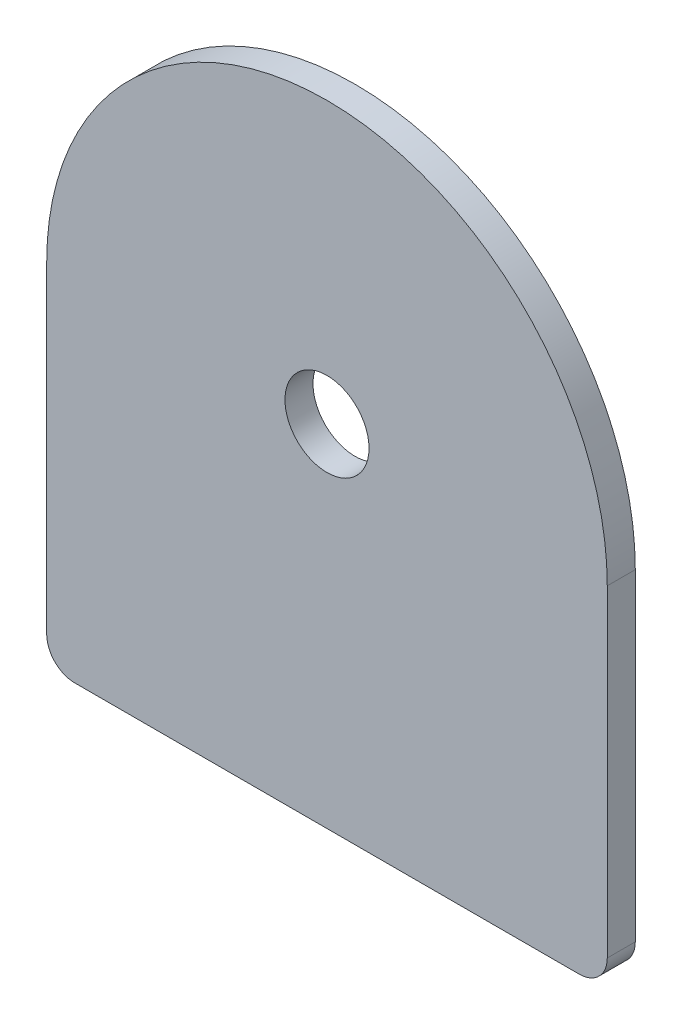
ISO-10303-21;
HEADER;
FILE_DESCRIPTION(('STEP AP214'),'2;1');
FILE_NAME('part.step','',(''),(''),'','','');
FILE_SCHEMA(('AUTOMOTIVE_DESIGN { 1 0 10303 214 1 1 1 1 }'));
ENDSEC;
DATA;
#1=APPLICATION_CONTEXT('core data for automotive mechanical design processes');
#2=APPLICATION_PROTOCOL_DEFINITION('international standard','automotive_design',2000,#1);
#3=PRODUCT_CONTEXT('',#1,'mechanical');
#4=PRODUCT('Part','Part','',(#3));
#5=PRODUCT_RELATED_PRODUCT_CATEGORY('part','',(#4));
#6=PRODUCT_DEFINITION_FORMATION('','',#4);
#7=PRODUCT_DEFINITION_CONTEXT('part definition',#1,'design');
#8=PRODUCT_DEFINITION('design','',#6,#7);
#9=PRODUCT_DEFINITION_SHAPE('','',#8);
#10=(LENGTH_UNIT() NAMED_UNIT(*) SI_UNIT(.MILLI.,.METRE.));
#11=(NAMED_UNIT(*) PLANE_ANGLE_UNIT() SI_UNIT($,.RADIAN.));
#12=(NAMED_UNIT(*) SI_UNIT($,.STERADIAN.) SOLID_ANGLE_UNIT());
#13=UNCERTAINTY_MEASURE_WITH_UNIT(LENGTH_MEASURE(1.E-05),#10,'distance_accuracy_value','');
#14=(GEOMETRIC_REPRESENTATION_CONTEXT(3) GLOBAL_UNCERTAINTY_ASSIGNED_CONTEXT((#13)) GLOBAL_UNIT_ASSIGNED_CONTEXT((#10,
#11,#12)) REPRESENTATION_CONTEXT('',''));
#15=CARTESIAN_POINT('',(0.,0.,0.));
#16=DIRECTION('',(0.,0.,1.));
#17=DIRECTION('',(1.,0.,0.));
#18=AXIS2_PLACEMENT_3D('',#15,#16,#17);
#19=CARTESIAN_POINT('',(0.,0.,2.));
#20=DIRECTION('',(0.,0.,1.));
#21=DIRECTION('',(1.,0.,0.));
#22=AXIS2_PLACEMENT_3D('',#19,#20,#21);
#23=PLANE('',#22);
#24=CARTESIAN_POINT('',(0.,0.,2.));
#25=DIRECTION('',(0.,0.,1.));
#26=DIRECTION('',(1.,0.,0.));
#27=AXIS2_PLACEMENT_3D('',#24,#25,#26);
#28=CIRCLE('',#27,20.);
#29=CARTESIAN_POINT('',(20.,0.,2.));
#30=VERTEX_POINT('',#29);
#31=CARTESIAN_POINT('',(-20.,0.,2.));
#32=VERTEX_POINT('',#31);
#33=EDGE_CURVE('E112',#30,#32,#28,.T.);
#34=ORIENTED_EDGE('',*,*,#33,.T.);
#35=DIRECTION('',(0.,-1.,0.));
#36=VECTOR('',#35,1.);
#37=CARTESIAN_POINT('',(-20.,0.,2.));
#38=LINE('',#37,#36);
#39=CARTESIAN_POINT('',(-20.,-23.,2.));
#40=VERTEX_POINT('',#39);
#41=EDGE_CURVE('E93',#32,#40,#38,.T.);
#42=ORIENTED_EDGE('',*,*,#41,.T.);
#43=CARTESIAN_POINT('',(-18.,-23.,2.));
#44=DIRECTION('',(0.,0.,1.));
#45=DIRECTION('',(1.,0.,0.));
#46=AXIS2_PLACEMENT_3D('',#43,#44,#45);
#47=CIRCLE('',#46,2.);
#48=CARTESIAN_POINT('',(-18.,-25.,2.));
#49=VERTEX_POINT('',#48);
#50=EDGE_CURVE('E115',#40,#49,#47,.T.);
#51=ORIENTED_EDGE('',*,*,#50,.T.);
#52=DIRECTION('',(1.,0.,0.));
#53=VECTOR('',#52,1.);
#54=CARTESIAN_POINT('',(-18.,-25.,2.));
#55=LINE('',#54,#53);
#56=CARTESIAN_POINT('',(18.,-25.,2.));
#57=VERTEX_POINT('',#56);
#58=EDGE_CURVE('E117',#49,#57,#55,.T.);
#59=ORIENTED_EDGE('',*,*,#58,.T.);
#60=CARTESIAN_POINT('',(18.,-23.,2.));
#61=DIRECTION('',(0.,0.,1.));
#62=DIRECTION('',(1.,0.,0.));
#63=AXIS2_PLACEMENT_3D('',#60,#61,#62);
#64=CIRCLE('',#63,2.);
#65=CARTESIAN_POINT('',(20.,-23.,2.));
#66=VERTEX_POINT('',#65);
#67=EDGE_CURVE('E46',#57,#66,#64,.T.);
#68=ORIENTED_EDGE('',*,*,#67,.T.);
#69=DIRECTION('',(0.,1.,0.));
#70=VECTOR('',#69,1.);
#71=CARTESIAN_POINT('',(20.,0.,2.));
#72=LINE('',#71,#70);
#73=EDGE_CURVE('E41',#66,#30,#72,.T.);
#74=ORIENTED_EDGE('',*,*,#73,.T.);
#75=EDGE_LOOP('',(#34,#42,#51,#59,#68,#74));
#76=FACE_BOUND('',#75,.T.);
#77=CARTESIAN_POINT('',(0.,0.,2.));
#78=DIRECTION('',(0.,0.,1.));
#79=DIRECTION('',(1.,0.,0.));
#80=AXIS2_PLACEMENT_3D('',#77,#78,#79);
#81=CIRCLE('',#80,3.);
#82=CARTESIAN_POINT('',(3.,0.,2.));
#83=VERTEX_POINT('',#82);
#84=EDGE_CURVE('E98',#83,#83,#81,.T.);
#85=ORIENTED_EDGE('',*,*,#84,.F.);
#86=EDGE_LOOP('',(#85));
#87=FACE_BOUND('',#86,.T.);
#88=ADVANCED_FACE('F26',(#76,#87),#23,.T.);
#89=CARTESIAN_POINT('',(0.,0.,0.));
#90=DIRECTION('',(0.,0.,1.));
#91=DIRECTION('',(1.,0.,0.));
#92=AXIS2_PLACEMENT_3D('',#89,#90,#91);
#93=PLANE('',#92);
#94=CARTESIAN_POINT('',(0.,0.,0.));
#95=DIRECTION('',(0.,0.,1.));
#96=DIRECTION('',(1.,0.,0.));
#97=AXIS2_PLACEMENT_3D('',#94,#95,#96);
#98=CIRCLE('',#97,20.);
#99=CARTESIAN_POINT('',(20.,0.,0.));
#100=VERTEX_POINT('',#99);
#101=CARTESIAN_POINT('',(-20.,0.,0.));
#102=VERTEX_POINT('',#101);
#103=EDGE_CURVE('E84',#100,#102,#98,.T.);
#104=ORIENTED_EDGE('',*,*,#103,.F.);
#105=DIRECTION('',(0.,1.,0.));
#106=VECTOR('',#105,1.);
#107=CARTESIAN_POINT('',(20.,0.,0.));
#108=LINE('',#107,#106);
#109=CARTESIAN_POINT('',(20.,-23.,0.));
#110=VERTEX_POINT('',#109);
#111=EDGE_CURVE('E110',#110,#100,#108,.T.);
#112=ORIENTED_EDGE('',*,*,#111,.F.);
#113=CARTESIAN_POINT('',(18.,-23.,0.));
#114=DIRECTION('',(0.,0.,1.));
#115=DIRECTION('',(1.,0.,0.));
#116=AXIS2_PLACEMENT_3D('',#113,#114,#115);
#117=CIRCLE('',#116,2.);
#118=CARTESIAN_POINT('',(18.,-25.,0.));
#119=VERTEX_POINT('',#118);
#120=EDGE_CURVE('E108',#119,#110,#117,.T.);
#121=ORIENTED_EDGE('',*,*,#120,.F.);
#122=DIRECTION('',(1.,0.,0.));
#123=VECTOR('',#122,1.);
#124=CARTESIAN_POINT('',(-18.,-25.,0.));
#125=LINE('',#124,#123);
#126=CARTESIAN_POINT('',(-18.,-25.,0.));
#127=VERTEX_POINT('',#126);
#128=EDGE_CURVE('E106',#127,#119,#125,.T.);
#129=ORIENTED_EDGE('',*,*,#128,.F.);
#130=CARTESIAN_POINT('',(-18.,-23.,0.));
#131=DIRECTION('',(0.,0.,1.));
#132=DIRECTION('',(1.,0.,0.));
#133=AXIS2_PLACEMENT_3D('',#130,#131,#132);
#134=CIRCLE('',#133,2.);
#135=CARTESIAN_POINT('',(-20.,-23.,0.));
#136=VERTEX_POINT('',#135);
#137=EDGE_CURVE('E86',#136,#127,#134,.T.);
#138=ORIENTED_EDGE('',*,*,#137,.F.);
#139=DIRECTION('',(0.,-1.,0.));
#140=VECTOR('',#139,1.);
#141=CARTESIAN_POINT('',(-20.,0.,0.));
#142=LINE('',#141,#140);
#143=EDGE_CURVE('E79',#102,#136,#142,.T.);
#144=ORIENTED_EDGE('',*,*,#143,.F.);
#145=EDGE_LOOP('',(#104,#112,#121,#129,#138,#144));
#146=FACE_BOUND('',#145,.T.);
#147=CARTESIAN_POINT('',(0.,0.,0.));
#148=DIRECTION('',(0.,0.,1.));
#149=DIRECTION('',(1.,0.,0.));
#150=AXIS2_PLACEMENT_3D('',#147,#148,#149);
#151=CIRCLE('',#150,3.);
#152=CARTESIAN_POINT('',(3.,0.,0.));
#153=VERTEX_POINT('',#152);
#154=EDGE_CURVE('E101',#153,#153,#151,.T.);
#155=ORIENTED_EDGE('',*,*,#154,.T.);
#156=EDGE_LOOP('',(#155));
#157=FACE_BOUND('',#156,.T.);
#158=ADVANCED_FACE('F80',(#146,#157),#93,.F.);
#159=CARTESIAN_POINT('',(0.,0.,2.));
#160=DIRECTION('',(0.,0.,-1.));
#161=DIRECTION('',(-1.,0.,0.));
#162=AXIS2_PLACEMENT_3D('',#159,#160,#161);
#163=CYLINDRICAL_SURFACE('',#162,20.);
#164=ORIENTED_EDGE('',*,*,#103,.T.);
#165=DIRECTION('',(0.,0.,-1.));
#166=VECTOR('',#165,1.);
#167=CARTESIAN_POINT('',(-20.,0.,2.));
#168=LINE('',#167,#166);
#169=EDGE_CURVE('E11',#32,#102,#168,.T.);
#170=ORIENTED_EDGE('',*,*,#169,.F.);
#171=ORIENTED_EDGE('',*,*,#33,.F.);
#172=DIRECTION('',(0.,0.,-1.));
#173=VECTOR('',#172,1.);
#174=CARTESIAN_POINT('',(20.,0.,2.));
#175=LINE('',#174,#173);
#176=EDGE_CURVE('E97',#30,#100,#175,.T.);
#177=ORIENTED_EDGE('',*,*,#176,.T.);
#178=EDGE_LOOP('',(#164,#170,#171,#177));
#179=FACE_BOUND('',#178,.T.);
#180=ADVANCED_FACE('F28',(#179),#163,.T.);
#181=CARTESIAN_POINT('',(-20.,0.,2.));
#182=DIRECTION('',(1.,0.,0.));
#183=DIRECTION('',(0.,0.,-1.));
#184=AXIS2_PLACEMENT_3D('',#181,#182,#183);
#185=PLANE('',#184);
#186=ORIENTED_EDGE('',*,*,#143,.T.);
#187=DIRECTION('',(0.,0.,-1.));
#188=VECTOR('',#187,1.);
#189=CARTESIAN_POINT('',(-20.,-23.,2.));
#190=LINE('',#189,#188);
#191=EDGE_CURVE('E34',#40,#136,#190,.T.);
#192=ORIENTED_EDGE('',*,*,#191,.F.);
#193=ORIENTED_EDGE('',*,*,#41,.F.);
#194=ORIENTED_EDGE('',*,*,#169,.T.);
#195=EDGE_LOOP('',(#186,#192,#193,#194));
#196=FACE_BOUND('',#195,.T.);
#197=ADVANCED_FACE('F92',(#196),#185,.F.);
#198=CARTESIAN_POINT('',(-18.,-23.,2.));
#199=DIRECTION('',(0.,0.,-1.));
#200=DIRECTION('',(-1.,0.,0.));
#201=AXIS2_PLACEMENT_3D('',#198,#199,#200);
#202=CYLINDRICAL_SURFACE('',#201,2.);
#203=ORIENTED_EDGE('',*,*,#137,.T.);
#204=DIRECTION('',(0.,0.,-1.));
#205=VECTOR('',#204,1.);
#206=CARTESIAN_POINT('',(-18.,-25.,2.));
#207=LINE('',#206,#205);
#208=EDGE_CURVE('E128',#49,#127,#207,.T.);
#209=ORIENTED_EDGE('',*,*,#208,.F.);
#210=ORIENTED_EDGE('',*,*,#50,.F.);
#211=ORIENTED_EDGE('',*,*,#191,.T.);
#212=EDGE_LOOP('',(#203,#209,#210,#211));
#213=FACE_BOUND('',#212,.T.);
#214=ADVANCED_FACE('F132',(#213),#202,.T.);
#215=CARTESIAN_POINT('',(-18.,-25.,2.));
#216=DIRECTION('',(0.,1.,0.));
#217=DIRECTION('',(0.,0.,1.));
#218=AXIS2_PLACEMENT_3D('',#215,#216,#217);
#219=PLANE('',#218);
#220=ORIENTED_EDGE('',*,*,#128,.T.);
#221=DIRECTION('',(0.,0.,-1.));
#222=VECTOR('',#221,1.);
#223=CARTESIAN_POINT('',(18.,-25.,2.));
#224=LINE('',#223,#222);
#225=EDGE_CURVE('E125',#57,#119,#224,.T.);
#226=ORIENTED_EDGE('',*,*,#225,.F.);
#227=ORIENTED_EDGE('',*,*,#58,.F.);
#228=ORIENTED_EDGE('',*,*,#208,.T.);
#229=EDGE_LOOP('',(#220,#226,#227,#228));
#230=FACE_BOUND('',#229,.T.);
#231=ADVANCED_FACE('F138',(#230),#219,.F.);
#232=CARTESIAN_POINT('',(18.,-23.,2.));
#233=DIRECTION('',(0.,0.,-1.));
#234=DIRECTION('',(-1.,0.,0.));
#235=AXIS2_PLACEMENT_3D('',#232,#233,#234);
#236=CYLINDRICAL_SURFACE('',#235,2.);
#237=ORIENTED_EDGE('',*,*,#120,.T.);
#238=DIRECTION('',(0.,0.,-1.));
#239=VECTOR('',#238,1.);
#240=CARTESIAN_POINT('',(20.,-23.,2.));
#241=LINE('',#240,#239);
#242=EDGE_CURVE('E122',#66,#110,#241,.T.);
#243=ORIENTED_EDGE('',*,*,#242,.F.);
#244=ORIENTED_EDGE('',*,*,#67,.F.);
#245=ORIENTED_EDGE('',*,*,#225,.T.);
#246=EDGE_LOOP('',(#237,#243,#244,#245));
#247=FACE_BOUND('',#246,.T.);
#248=ADVANCED_FACE('F141',(#247),#236,.T.);
#249=CARTESIAN_POINT('',(20.,0.,2.));
#250=DIRECTION('',(-1.,0.,0.));
#251=DIRECTION('',(0.,0.,1.));
#252=AXIS2_PLACEMENT_3D('',#249,#250,#251);
#253=PLANE('',#252);
#254=ORIENTED_EDGE('',*,*,#111,.T.);
#255=ORIENTED_EDGE('',*,*,#176,.F.);
#256=ORIENTED_EDGE('',*,*,#73,.F.);
#257=ORIENTED_EDGE('',*,*,#242,.T.);
#258=EDGE_LOOP('',(#254,#255,#256,#257));
#259=FACE_BOUND('',#258,.T.);
#260=ADVANCED_FACE('F143',(#259),#253,.F.);
#261=CARTESIAN_POINT('',(0.,0.,2.));
#262=DIRECTION('',(0.,0.,-1.));
#263=DIRECTION('',(-1.,0.,0.));
#264=AXIS2_PLACEMENT_3D('',#261,#262,#263);
#265=CYLINDRICAL_SURFACE('',#264,3.);
#266=ORIENTED_EDGE('',*,*,#84,.T.);
#267=EDGE_LOOP('',(#266));
#268=FACE_BOUND('',#267,.T.);
#269=ORIENTED_EDGE('',*,*,#154,.F.);
#270=EDGE_LOOP('',(#269));
#271=FACE_BOUND('',#270,.T.);
#272=ADVANCED_FACE('F145',(#268,#271),#265,.F.);
#273=CLOSED_SHELL('',(#88,#158,#180,#197,#214,#231,#248,#260,#272));
#274=MANIFOLD_SOLID_BREP('B2',#273);
#275=ADVANCED_BREP_SHAPE_REPRESENTATION('',(#18,#274),#14);
#276=SHAPE_DEFINITION_REPRESENTATION(#9,#275);
ENDSEC;
END-ISO-10303-21;
